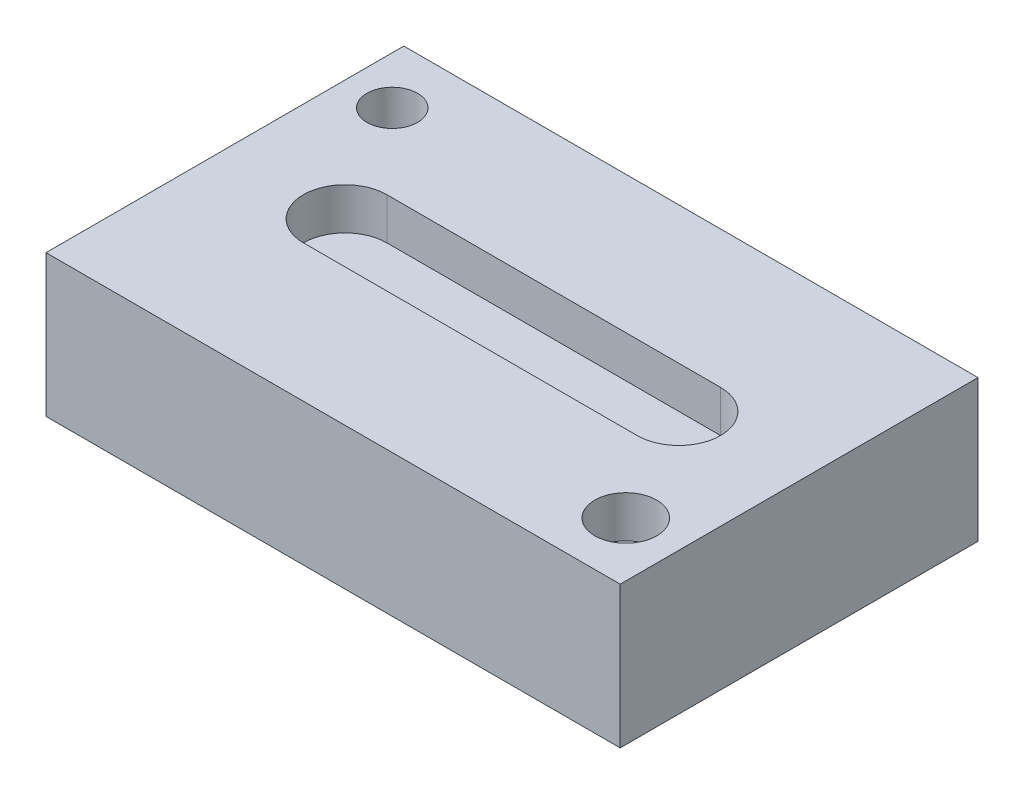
ISO-10303-21;
HEADER;
FILE_DESCRIPTION(('STEP AP214'),'2;1');
FILE_NAME('part.step','',(''),(''),'','','');
FILE_SCHEMA(('AUTOMOTIVE_DESIGN { 1 0 10303 214 1 1 1 1 }'));
ENDSEC;
DATA;
#1=APPLICATION_CONTEXT('core data for automotive mechanical design processes');
#2=APPLICATION_PROTOCOL_DEFINITION('international standard','automotive_design',2000,#1);
#3=PRODUCT_CONTEXT('',#1,'mechanical');
#4=PRODUCT('Part','Part','',(#3));
#5=PRODUCT_RELATED_PRODUCT_CATEGORY('part','',(#4));
#6=PRODUCT_DEFINITION_FORMATION('','',#4);
#7=PRODUCT_DEFINITION_CONTEXT('part definition',#1,'design');
#8=PRODUCT_DEFINITION('design','',#6,#7);
#9=PRODUCT_DEFINITION_SHAPE('','',#8);
#10=(LENGTH_UNIT() NAMED_UNIT(*) SI_UNIT(.MILLI.,.METRE.));
#11=(NAMED_UNIT(*) PLANE_ANGLE_UNIT() SI_UNIT($,.RADIAN.));
#12=(NAMED_UNIT(*) SI_UNIT($,.STERADIAN.) SOLID_ANGLE_UNIT());
#13=UNCERTAINTY_MEASURE_WITH_UNIT(LENGTH_MEASURE(1.E-05),#10,'distance_accuracy_value','');
#14=(GEOMETRIC_REPRESENTATION_CONTEXT(3) GLOBAL_UNCERTAINTY_ASSIGNED_CONTEXT((#13)) GLOBAL_UNIT_ASSIGNED_CONTEXT((#10,
#11,#12)) REPRESENTATION_CONTEXT('',''));
#15=CARTESIAN_POINT('',(0.,0.,0.));
#16=DIRECTION('',(0.,0.,1.));
#17=DIRECTION('',(1.,0.,0.));
#18=AXIS2_PLACEMENT_3D('',#15,#16,#17);
#19=CARTESIAN_POINT('',(87.39808345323,43.18,54.4636150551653));
#20=DIRECTION('',(-1.,0.,0.));
#21=DIRECTION('',(0.,0.,1.));
#22=AXIS2_PLACEMENT_3D('',#19,#20,#21);
#23=PLANE('',#22);
#24=DIRECTION('',(0.,0.,-1.));
#25=VECTOR('',#24,1.);
#26=CARTESIAN_POINT('',(87.39808345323,0.,54.4636150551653));
#27=LINE('',#26,#25);
#28=CARTESIAN_POINT('',(87.39808345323,0.,54.4636150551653));
#29=VERTEX_POINT('',#28);
#30=CARTESIAN_POINT('',(87.39808345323,0.,-54.4636150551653));
#31=VERTEX_POINT('',#30);
#32=EDGE_CURVE('E188',#29,#31,#27,.T.);
#33=ORIENTED_EDGE('',*,*,#32,.T.);
#34=DIRECTION('',(0.,-1.,0.));
#35=VECTOR('',#34,1.);
#36=CARTESIAN_POINT('',(87.39808345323,43.18,-54.4636150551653));
#37=LINE('',#36,#35);
#38=CARTESIAN_POINT('',(87.39808345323,43.18,-54.4636150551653));
#39=VERTEX_POINT('',#38);
#40=EDGE_CURVE('E12',#39,#31,#37,.T.);
#41=ORIENTED_EDGE('',*,*,#40,.F.);
#42=DIRECTION('',(0.,0.,-1.));
#43=VECTOR('',#42,1.);
#44=CARTESIAN_POINT('',(87.39808345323,43.18,54.4636150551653));
#45=LINE('',#44,#43);
#46=CARTESIAN_POINT('',(87.39808345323,43.18,54.4636150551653));
#47=VERTEX_POINT('',#46);
#48=EDGE_CURVE('E197',#47,#39,#45,.T.);
#49=ORIENTED_EDGE('',*,*,#48,.F.);
#50=DIRECTION('',(0.,-1.,0.));
#51=VECTOR('',#50,1.);
#52=CARTESIAN_POINT('',(87.39808345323,43.18,54.4636150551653));
#53=LINE('',#52,#51);
#54=EDGE_CURVE('E207',#47,#29,#53,.T.);
#55=ORIENTED_EDGE('',*,*,#54,.T.);
#56=EDGE_LOOP('',(#33,#41,#49,#55));
#57=FACE_BOUND('',#56,.T.);
#58=ADVANCED_FACE('F48',(#57),#23,.F.);
#59=CARTESIAN_POINT('',(-87.39808345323,43.18,-54.4636150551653));
#60=DIRECTION('',(0.,0.,1.));
#61=DIRECTION('',(1.,0.,0.));
#62=AXIS2_PLACEMENT_3D('',#59,#60,#61);
#63=PLANE('',#62);
#64=DIRECTION('',(-1.,0.,0.));
#65=VECTOR('',#64,1.);
#66=CARTESIAN_POINT('',(-87.39808345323,0.,-54.4636150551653));
#67=LINE('',#66,#65);
#68=CARTESIAN_POINT('',(-87.39808345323,0.,-54.4636150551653));
#69=VERTEX_POINT('',#68);
#70=EDGE_CURVE('E211',#31,#69,#67,.T.);
#71=ORIENTED_EDGE('',*,*,#70,.T.);
#72=DIRECTION('',(0.,-1.,0.));
#73=VECTOR('',#72,1.);
#74=CARTESIAN_POINT('',(-87.39808345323,43.18,-54.4636150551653));
#75=LINE('',#74,#73);
#76=CARTESIAN_POINT('',(-87.39808345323,43.18,-54.4636150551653));
#77=VERTEX_POINT('',#76);
#78=EDGE_CURVE('E56',#77,#69,#75,.T.);
#79=ORIENTED_EDGE('',*,*,#78,.F.);
#80=DIRECTION('',(-1.,0.,0.));
#81=VECTOR('',#80,1.);
#82=CARTESIAN_POINT('',(-87.39808345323,43.18,-54.4636150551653));
#83=LINE('',#82,#81);
#84=EDGE_CURVE('E100',#39,#77,#83,.T.);
#85=ORIENTED_EDGE('',*,*,#84,.F.);
#86=ORIENTED_EDGE('',*,*,#40,.T.);
#87=EDGE_LOOP('',(#71,#79,#85,#86));
#88=FACE_BOUND('',#87,.T.);
#89=ADVANCED_FACE('F246',(#88),#63,.F.);
#90=CARTESIAN_POINT('',(-87.39808345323,43.18,54.4636150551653));
#91=DIRECTION('',(1.,0.,0.));
#92=DIRECTION('',(0.,0.,-1.));
#93=AXIS2_PLACEMENT_3D('',#90,#91,#92);
#94=PLANE('',#93);
#95=DIRECTION('',(0.,0.,1.));
#96=VECTOR('',#95,1.);
#97=CARTESIAN_POINT('',(-87.39808345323,0.,54.4636150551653));
#98=LINE('',#97,#96);
#99=CARTESIAN_POINT('',(-87.39808345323,0.,54.4636150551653));
#100=VERTEX_POINT('',#99);
#101=EDGE_CURVE('E214',#69,#100,#98,.T.);
#102=ORIENTED_EDGE('',*,*,#101,.T.);
#103=DIRECTION('',(0.,-1.,0.));
#104=VECTOR('',#103,1.);
#105=CARTESIAN_POINT('',(-87.39808345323,43.18,54.4636150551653));
#106=LINE('',#105,#104);
#107=CARTESIAN_POINT('',(-87.39808345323,43.18,54.4636150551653));
#108=VERTEX_POINT('',#107);
#109=EDGE_CURVE('E221',#108,#100,#106,.T.);
#110=ORIENTED_EDGE('',*,*,#109,.F.);
#111=DIRECTION('',(0.,0.,1.));
#112=VECTOR('',#111,1.);
#113=CARTESIAN_POINT('',(-87.39808345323,43.18,54.4636150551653));
#114=LINE('',#113,#112);
#115=EDGE_CURVE('E202',#77,#108,#114,.T.);
#116=ORIENTED_EDGE('',*,*,#115,.F.);
#117=ORIENTED_EDGE('',*,*,#78,.T.);
#118=EDGE_LOOP('',(#102,#110,#116,#117));
#119=FACE_BOUND('',#118,.T.);
#120=ADVANCED_FACE('F228',(#119),#94,.F.);
#121=CARTESIAN_POINT('',(-87.39808345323,43.18,54.4636150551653));
#122=DIRECTION('',(0.,0.,-1.));
#123=DIRECTION('',(-1.,0.,0.));
#124=AXIS2_PLACEMENT_3D('',#121,#122,#123);
#125=PLANE('',#124);
#126=DIRECTION('',(1.,0.,0.));
#127=VECTOR('',#126,1.);
#128=CARTESIAN_POINT('',(-87.39808345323,0.,54.4636150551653));
#129=LINE('',#128,#127);
#130=EDGE_CURVE('E93',#100,#29,#129,.T.);
#131=ORIENTED_EDGE('',*,*,#130,.T.);
#132=ORIENTED_EDGE('',*,*,#54,.F.);
#133=DIRECTION('',(1.,0.,0.));
#134=VECTOR('',#133,1.);
#135=CARTESIAN_POINT('',(-87.39808345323,43.18,54.4636150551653));
#136=LINE('',#135,#134);
#137=EDGE_CURVE('E72',#108,#47,#136,.T.);
#138=ORIENTED_EDGE('',*,*,#137,.F.);
#139=ORIENTED_EDGE('',*,*,#109,.T.);
#140=EDGE_LOOP('',(#131,#132,#138,#139));
#141=FACE_BOUND('',#140,.T.);
#142=ADVANCED_FACE('F236',(#141),#125,.F.);
#143=CARTESIAN_POINT('',(0.,43.18,0.));
#144=DIRECTION('',(0.,-1.,0.));
#145=DIRECTION('',(0.,0.,-1.));
#146=AXIS2_PLACEMENT_3D('',#143,#144,#145);
#147=PLANE('',#146);
#148=CARTESIAN_POINT('',(70.8012631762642,43.18,36.1578333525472));
#149=DIRECTION('',(0.,1.,0.));
#150=DIRECTION('',(0.,0.,1.));
#151=AXIS2_PLACEMENT_3D('',#148,#149,#150);
#152=CIRCLE('',#151,9.43080752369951);
#153=CARTESIAN_POINT('',(70.8012631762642,43.18,45.5886408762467));
#154=VERTEX_POINT('',#153);
#155=EDGE_CURVE('E154',#154,#154,#152,.T.);
#156=ORIENTED_EDGE('',*,*,#155,.F.);
#157=EDGE_LOOP('',(#156));
#158=FACE_BOUND('',#157,.T.);
#159=CARTESIAN_POINT('',(-72.8740366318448,43.18,-36.4086310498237));
#160=DIRECTION('',(0.,1.,0.));
#161=DIRECTION('',(0.,0.,1.));
#162=AXIS2_PLACEMENT_3D('',#159,#160,#161);
#163=CIRCLE('',#162,7.69741318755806);
#164=CARTESIAN_POINT('',(-72.8740366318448,43.18,-28.7112178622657));
#165=VERTEX_POINT('',#164);
#166=EDGE_CURVE('E408',#165,#165,#163,.T.);
#167=ORIENTED_EDGE('',*,*,#166,.F.);
#168=EDGE_LOOP('',(#167));
#169=FACE_BOUND('',#168,.T.);
#170=DIRECTION('',(1.,0.,0.));
#171=VECTOR('',#170,1.);
#172=CARTESIAN_POINT('',(-50.8,43.18,12.7));
#173=LINE('',#172,#171);
#174=CARTESIAN_POINT('',(-50.8,43.18,12.7));
#175=VERTEX_POINT('',#174);
#176=CARTESIAN_POINT('',(50.8,43.18,12.7));
#177=VERTEX_POINT('',#176);
#178=EDGE_CURVE('E174',#175,#177,#173,.T.);
#179=ORIENTED_EDGE('',*,*,#178,.F.);
#180=CARTESIAN_POINT('',(-50.8,43.18,0.));
#181=DIRECTION('',(0.,1.,0.));
#182=DIRECTION('',(0.,0.,1.));
#183=AXIS2_PLACEMENT_3D('',#180,#181,#182);
#184=CIRCLE('',#183,12.7);
#185=CARTESIAN_POINT('',(-50.8,43.18,-12.7));
#186=VERTEX_POINT('',#185);
#187=EDGE_CURVE('E63',#186,#175,#184,.T.);
#188=ORIENTED_EDGE('',*,*,#187,.F.);
#189=DIRECTION('',(-1.,0.,0.));
#190=VECTOR('',#189,1.);
#191=CARTESIAN_POINT('',(-50.8,43.18,-12.7));
#192=LINE('',#191,#190);
#193=CARTESIAN_POINT('',(50.8,43.18,-12.7));
#194=VERTEX_POINT('',#193);
#195=EDGE_CURVE('E146',#194,#186,#192,.T.);
#196=ORIENTED_EDGE('',*,*,#195,.F.);
#197=CARTESIAN_POINT('',(50.8,43.18,0.));
#198=DIRECTION('',(0.,1.,0.));
#199=DIRECTION('',(0.,0.,1.));
#200=AXIS2_PLACEMENT_3D('',#197,#198,#199);
#201=CIRCLE('',#200,12.7);
#202=EDGE_CURVE('E150',#177,#194,#201,.T.);
#203=ORIENTED_EDGE('',*,*,#202,.F.);
#204=EDGE_LOOP('',(#179,#188,#196,#203));
#205=FACE_BOUND('',#204,.T.);
#206=ORIENTED_EDGE('',*,*,#48,.T.);
#207=ORIENTED_EDGE('',*,*,#84,.T.);
#208=ORIENTED_EDGE('',*,*,#115,.T.);
#209=ORIENTED_EDGE('',*,*,#137,.T.);
#210=EDGE_LOOP('',(#206,#207,#208,#209));
#211=FACE_BOUND('',#210,.T.);
#212=ADVANCED_FACE('F238',(#158,#169,#205,#211),#147,.F.);
#213=CARTESIAN_POINT('',(0.,0.,0.));
#214=DIRECTION('',(0.,-1.,0.));
#215=DIRECTION('',(0.,0.,-1.));
#216=AXIS2_PLACEMENT_3D('',#213,#214,#215);
#217=PLANE('',#216);
#218=ORIENTED_EDGE('',*,*,#32,.F.);
#219=ORIENTED_EDGE('',*,*,#130,.F.);
#220=ORIENTED_EDGE('',*,*,#101,.F.);
#221=ORIENTED_EDGE('',*,*,#70,.F.);
#222=EDGE_LOOP('',(#218,#219,#220,#221));
#223=FACE_BOUND('',#222,.T.);
#224=ADVANCED_FACE('F232',(#223),#217,.T.);
#225=CARTESIAN_POINT('',(-50.8,30.48,0.));
#226=DIRECTION('',(0.,1.,0.));
#227=DIRECTION('',(0.,0.,1.));
#228=AXIS2_PLACEMENT_3D('',#225,#226,#227);
#229=CYLINDRICAL_SURFACE('',#228,12.7);
#230=ORIENTED_EDGE('',*,*,#187,.T.);
#231=DIRECTION('',(0.,1.,0.));
#232=VECTOR('',#231,1.);
#233=CARTESIAN_POINT('',(-50.8,30.48,12.7));
#234=LINE('',#233,#232);
#235=CARTESIAN_POINT('',(-50.8,30.48,12.7));
#236=VERTEX_POINT('',#235);
#237=EDGE_CURVE('E120',#236,#175,#234,.T.);
#238=ORIENTED_EDGE('',*,*,#237,.F.);
#239=CARTESIAN_POINT('',(-50.8,30.48,0.));
#240=DIRECTION('',(0.,1.,0.));
#241=DIRECTION('',(0.,0.,1.));
#242=AXIS2_PLACEMENT_3D('',#239,#240,#241);
#243=CIRCLE('',#242,12.7);
#244=CARTESIAN_POINT('',(-50.8,30.48,-12.7));
#245=VERTEX_POINT('',#244);
#246=EDGE_CURVE('E124',#245,#236,#243,.T.);
#247=ORIENTED_EDGE('',*,*,#246,.F.);
#248=DIRECTION('',(0.,1.,0.));
#249=VECTOR('',#248,1.);
#250=CARTESIAN_POINT('',(-50.8,30.48,-12.7));
#251=LINE('',#250,#249);
#252=EDGE_CURVE('E185',#245,#186,#251,.T.);
#253=ORIENTED_EDGE('',*,*,#252,.T.);
#254=EDGE_LOOP('',(#230,#238,#247,#253));
#255=FACE_BOUND('',#254,.T.);
#256=ADVANCED_FACE('F122',(#255),#229,.F.);
#257=CARTESIAN_POINT('',(-50.8,30.48,-12.7));
#258=DIRECTION('',(0.,0.,-1.));
#259=DIRECTION('',(-1.,0.,0.));
#260=AXIS2_PLACEMENT_3D('',#257,#258,#259);
#261=PLANE('',#260);
#262=ORIENTED_EDGE('',*,*,#195,.T.);
#263=ORIENTED_EDGE('',*,*,#252,.F.);
#264=DIRECTION('',(-1.,0.,0.));
#265=VECTOR('',#264,1.);
#266=CARTESIAN_POINT('',(-50.8,30.48,-12.7));
#267=LINE('',#266,#265);
#268=CARTESIAN_POINT('',(50.8,30.48,-12.7));
#269=VERTEX_POINT('',#268);
#270=EDGE_CURVE('E131',#269,#245,#267,.T.);
#271=ORIENTED_EDGE('',*,*,#270,.F.);
#272=DIRECTION('',(0.,1.,0.));
#273=VECTOR('',#272,1.);
#274=CARTESIAN_POINT('',(50.8,30.48,-12.7));
#275=LINE('',#274,#273);
#276=EDGE_CURVE('E189',#269,#194,#275,.T.);
#277=ORIENTED_EDGE('',*,*,#276,.T.);
#278=EDGE_LOOP('',(#262,#263,#271,#277));
#279=FACE_BOUND('',#278,.T.);
#280=ADVANCED_FACE('F283',(#279),#261,.F.);
#281=CARTESIAN_POINT('',(50.8,30.48,0.));
#282=DIRECTION('',(0.,1.,0.));
#283=DIRECTION('',(0.,0.,1.));
#284=AXIS2_PLACEMENT_3D('',#281,#282,#283);
#285=CYLINDRICAL_SURFACE('',#284,12.7);
#286=ORIENTED_EDGE('',*,*,#202,.T.);
#287=ORIENTED_EDGE('',*,*,#276,.F.);
#288=CARTESIAN_POINT('',(50.8,30.48,0.));
#289=DIRECTION('',(0.,1.,0.));
#290=DIRECTION('',(0.,0.,1.));
#291=AXIS2_PLACEMENT_3D('',#288,#289,#290);
#292=CIRCLE('',#291,12.7);
#293=CARTESIAN_POINT('',(50.8,30.48,12.7));
#294=VERTEX_POINT('',#293);
#295=EDGE_CURVE('E140',#294,#269,#292,.T.);
#296=ORIENTED_EDGE('',*,*,#295,.F.);
#297=DIRECTION('',(0.,1.,0.));
#298=VECTOR('',#297,1.);
#299=CARTESIAN_POINT('',(50.8,30.48,12.7));
#300=LINE('',#299,#298);
#301=EDGE_CURVE('E130',#294,#177,#300,.T.);
#302=ORIENTED_EDGE('',*,*,#301,.T.);
#303=EDGE_LOOP('',(#286,#287,#296,#302));
#304=FACE_BOUND('',#303,.T.);
#305=ADVANCED_FACE('F294',(#304),#285,.F.);
#306=CARTESIAN_POINT('',(-50.8,30.48,12.7));
#307=DIRECTION('',(0.,0.,1.));
#308=DIRECTION('',(1.,0.,0.));
#309=AXIS2_PLACEMENT_3D('',#306,#307,#308);
#310=PLANE('',#309);
#311=ORIENTED_EDGE('',*,*,#178,.T.);
#312=ORIENTED_EDGE('',*,*,#301,.F.);
#313=DIRECTION('',(1.,0.,0.));
#314=VECTOR('',#313,1.);
#315=CARTESIAN_POINT('',(-50.8,30.48,12.7));
#316=LINE('',#315,#314);
#317=EDGE_CURVE('E134',#236,#294,#316,.T.);
#318=ORIENTED_EDGE('',*,*,#317,.F.);
#319=ORIENTED_EDGE('',*,*,#237,.T.);
#320=EDGE_LOOP('',(#311,#312,#318,#319));
#321=FACE_BOUND('',#320,.T.);
#322=ADVANCED_FACE('F135',(#321),#310,.F.);
#323=CARTESIAN_POINT('',(-50.8,30.48,0.));
#324=DIRECTION('',(0.,1.,0.));
#325=DIRECTION('',(0.,0.,1.));
#326=AXIS2_PLACEMENT_3D('',#323,#324,#325);
#327=PLANE('',#326);
#328=ORIENTED_EDGE('',*,*,#246,.T.);
#329=ORIENTED_EDGE('',*,*,#317,.T.);
#330=ORIENTED_EDGE('',*,*,#295,.T.);
#331=ORIENTED_EDGE('',*,*,#270,.T.);
#332=EDGE_LOOP('',(#328,#329,#330,#331));
#333=FACE_BOUND('',#332,.T.);
#334=ADVANCED_FACE('F143',(#333),#327,.T.);
#335=CARTESIAN_POINT('',(-72.8740366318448,30.48,-36.4086310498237));
#336=DIRECTION('',(0.,1.,0.));
#337=DIRECTION('',(0.,0.,1.));
#338=AXIS2_PLACEMENT_3D('',#335,#336,#337);
#339=CYLINDRICAL_SURFACE('',#338,7.69741318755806);
#340=CARTESIAN_POINT('',(-72.8740366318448,30.48,-36.4086310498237));
#341=DIRECTION('',(0.,1.,0.));
#342=DIRECTION('',(0.,0.,1.));
#343=AXIS2_PLACEMENT_3D('',#340,#341,#342);
#344=CIRCLE('',#343,7.69741318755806);
#345=CARTESIAN_POINT('',(-72.8740366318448,30.48,-28.7112178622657));
#346=VERTEX_POINT('',#345);
#347=EDGE_CURVE('E175',#346,#346,#344,.T.);
#348=ORIENTED_EDGE('',*,*,#347,.F.);
#349=EDGE_LOOP('',(#348));
#350=FACE_BOUND('',#349,.T.);
#351=ORIENTED_EDGE('',*,*,#166,.T.);
#352=EDGE_LOOP('',(#351));
#353=FACE_BOUND('',#352,.T.);
#354=ADVANCED_FACE('F319',(#350,#353),#339,.F.);
#355=CARTESIAN_POINT('',(-72.8740366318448,30.48,-36.4086310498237));
#356=DIRECTION('',(0.,1.,0.));
#357=DIRECTION('',(0.,0.,1.));
#358=AXIS2_PLACEMENT_3D('',#355,#356,#357);
#359=PLANE('',#358);
#360=ORIENTED_EDGE('',*,*,#347,.T.);
#361=EDGE_LOOP('',(#360));
#362=FACE_BOUND('',#361,.T.);
#363=ADVANCED_FACE('F328',(#362),#359,.T.);
#364=CARTESIAN_POINT('',(70.8012631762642,30.48,36.1578333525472));
#365=DIRECTION('',(0.,1.,0.));
#366=DIRECTION('',(0.,0.,1.));
#367=AXIS2_PLACEMENT_3D('',#364,#365,#366);
#368=CYLINDRICAL_SURFACE('',#367,9.43080752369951);
#369=CARTESIAN_POINT('',(70.8012631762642,30.48,36.1578333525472));
#370=DIRECTION('',(0.,1.,0.));
#371=DIRECTION('',(0.,0.,1.));
#372=AXIS2_PLACEMENT_3D('',#369,#370,#371);
#373=CIRCLE('',#372,9.43080752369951);
#374=CARTESIAN_POINT('',(70.8012631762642,30.48,45.5886408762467));
#375=VERTEX_POINT('',#374);
#376=EDGE_CURVE('E406',#375,#375,#373,.T.);
#377=ORIENTED_EDGE('',*,*,#376,.F.);
#378=EDGE_LOOP('',(#377));
#379=FACE_BOUND('',#378,.T.);
#380=ORIENTED_EDGE('',*,*,#155,.T.);
#381=EDGE_LOOP('',(#380));
#382=FACE_BOUND('',#381,.T.);
#383=ADVANCED_FACE('F338',(#379,#382),#368,.F.);
#384=CARTESIAN_POINT('',(70.8012631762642,30.48,36.1578333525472));
#385=DIRECTION('',(0.,1.,0.));
#386=DIRECTION('',(0.,0.,1.));
#387=AXIS2_PLACEMENT_3D('',#384,#385,#386);
#388=PLANE('',#387);
#389=ORIENTED_EDGE('',*,*,#376,.T.);
#390=EDGE_LOOP('',(#389));
#391=FACE_BOUND('',#390,.T.);
#392=ADVANCED_FACE('F347',(#391),#388,.T.);
#393=CLOSED_SHELL('',(#58,#89,#120,#142,#212,#224,#256,#280,#305,#322,#334,#354,#363,#383,#392));
#394=MANIFOLD_SOLID_BREP('B2',#393);
#395=ADVANCED_BREP_SHAPE_REPRESENTATION('',(#18,#394),#14);
#396=SHAPE_DEFINITION_REPRESENTATION(#9,#395);
ENDSEC;
END-ISO-10303-21;
